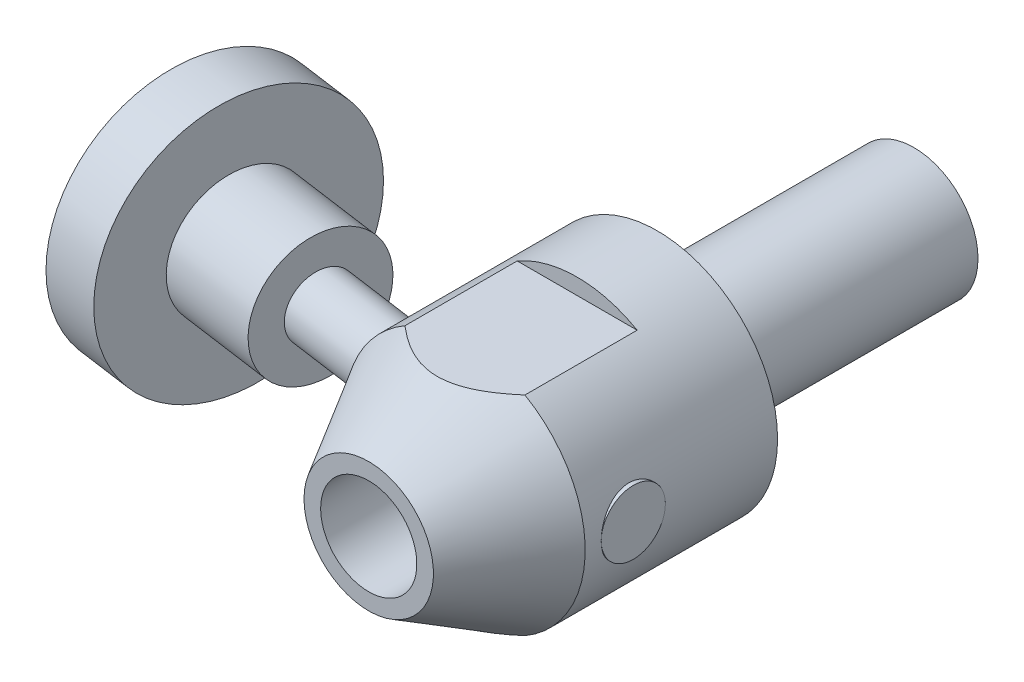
ISO-10303-21;
HEADER;
FILE_DESCRIPTION(('STEP AP214'),'2;1');
FILE_NAME('part.step','',(''),(''),'','','');
FILE_SCHEMA(('AUTOMOTIVE_DESIGN { 1 0 10303 214 1 1 1 1 }'));
ENDSEC;
DATA;
#1=APPLICATION_CONTEXT('core data for automotive mechanical design processes');
#2=APPLICATION_PROTOCOL_DEFINITION('international standard','automotive_design',2000,#1);
#3=PRODUCT_CONTEXT('',#1,'mechanical');
#4=PRODUCT('Part','Part','',(#3));
#5=PRODUCT_RELATED_PRODUCT_CATEGORY('part','',(#4));
#6=PRODUCT_DEFINITION_FORMATION('','',#4);
#7=PRODUCT_DEFINITION_CONTEXT('part definition',#1,'design');
#8=PRODUCT_DEFINITION('design','',#6,#7);
#9=PRODUCT_DEFINITION_SHAPE('','',#8);
#10=(LENGTH_UNIT() NAMED_UNIT(*) SI_UNIT(.MILLI.,.METRE.));
#11=(NAMED_UNIT(*) PLANE_ANGLE_UNIT() SI_UNIT($,.RADIAN.));
#12=(NAMED_UNIT(*) SI_UNIT($,.STERADIAN.) SOLID_ANGLE_UNIT());
#13=UNCERTAINTY_MEASURE_WITH_UNIT(LENGTH_MEASURE(1.E-05),#10,'distance_accuracy_value','');
#14=(GEOMETRIC_REPRESENTATION_CONTEXT(3) GLOBAL_UNCERTAINTY_ASSIGNED_CONTEXT((#13)) GLOBAL_UNIT_ASSIGNED_CONTEXT((#10,
#11,#12)) REPRESENTATION_CONTEXT('',''));
#15=CARTESIAN_POINT('',(0.,0.,0.));
#16=DIRECTION('',(0.,0.,1.));
#17=DIRECTION('',(1.,0.,0.));
#18=AXIS2_PLACEMENT_3D('',#15,#16,#17);
#19=CARTESIAN_POINT('',(7.5,0.,11.));
#20=DIRECTION('',(-1.,0.,0.));
#21=DIRECTION('',(0.,0.,1.));
#22=AXIS2_PLACEMENT_3D('',#19,#20,#21);
#23=PLANE('',#22);
#24=CARTESIAN_POINT('',(7.5,0.,9.));
#25=DIRECTION('',(1.,0.,0.));
#26=DIRECTION('',(0.,0.,-1.));
#27=AXIS2_PLACEMENT_3D('',#24,#25,#26);
#28=CIRCLE('',#27,2.);
#29=CARTESIAN_POINT('',(7.5,0.,7.));
#30=VERTEX_POINT('',#29);
#31=CARTESIAN_POINT('',(7.5,0.,11.));
#32=VERTEX_POINT('',#31);
#33=EDGE_CURVE('E249',#30,#32,#28,.T.);
#34=ORIENTED_EDGE('',*,*,#33,.T.);
#35=EDGE_CURVE('E89',#32,#30,#28,.T.);
#36=ORIENTED_EDGE('',*,*,#35,.T.);
#37=EDGE_LOOP('',(#34,#36));
#38=FACE_BOUND('',#37,.T.);
#39=ADVANCED_FACE('F14',(#38),#23,.F.);
#40=CARTESIAN_POINT('',(7.5,0.,9.));
#41=DIRECTION('',(1.,0.,0.));
#42=DIRECTION('',(0.,0.,-1.));
#43=AXIS2_PLACEMENT_3D('',#40,#41,#42);
#44=CYLINDRICAL_SURFACE('',#43,2.);
#45=CARTESIAN_POINT('',(7.5,0.,7.));
#46=CARTESIAN_POINT('',(7.49999833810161,-0.110254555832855,7.00000261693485));
#47=CARTESIAN_POINT('',(7.49754486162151,-0.220537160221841,7.00914761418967));
#48=CARTESIAN_POINT('',(7.48799573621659,-0.437925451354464,7.04542123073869));
#49=CARTESIAN_POINT('',(7.48089785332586,-0.545029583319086,7.07255850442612));
#50=CARTESIAN_POINT('',(7.46284333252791,-0.752891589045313,7.14387166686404));
#51=CARTESIAN_POINT('',(7.45189167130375,-0.853657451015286,7.18802558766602));
#52=CARTESIAN_POINT('',(7.42728699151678,-1.04635368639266,7.29203724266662));
#53=CARTESIAN_POINT('',(7.4136337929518,-1.13828347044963,7.35189602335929));
#54=CARTESIAN_POINT('',(7.38474614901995,-1.31282950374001,7.48708351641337));
#55=CARTESIAN_POINT('',(7.36948467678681,-1.39521168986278,7.56270866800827));
#56=CARTESIAN_POINT('',(7.33927409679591,-1.54628713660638,7.72664848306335));
#57=CARTESIAN_POINT('',(7.32432502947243,-1.61497863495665,7.81496477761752));
#58=CARTESIAN_POINT('',(7.29615537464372,-1.73786409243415,8.00364823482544));
#59=CARTESIAN_POINT('',(7.28296888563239,-1.79178877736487,8.10419632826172));
#60=CARTESIAN_POINT('',(7.26021477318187,-1.88187548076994,8.31334011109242));
#61=CARTESIAN_POINT('',(7.25064648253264,-1.91804077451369,8.42193431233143));
#62=CARTESIAN_POINT('',(7.23649115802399,-1.97076920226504,8.64149553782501));
#63=CARTESIAN_POINT('',(7.2317964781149,-1.98775670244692,8.75235353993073));
#64=CARTESIAN_POINT('',(7.22759830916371,-2.0029703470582,8.97543768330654));
#65=CARTESIAN_POINT('',(7.22809385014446,-2.00119999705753,9.08766356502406));
#66=CARTESIAN_POINT('',(7.23412378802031,-1.97928510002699,9.30698541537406));
#67=CARTESIAN_POINT('',(7.23951735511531,-1.95965406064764,9.41413718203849));
#68=CARTESIAN_POINT('',(7.25451013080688,-1.90339748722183,9.62356833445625));
#69=CARTESIAN_POINT('',(7.26410967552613,-1.86677059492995,9.72584733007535));
#70=CARTESIAN_POINT('',(7.28655661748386,-1.77714356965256,9.92396814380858));
#71=CARTESIAN_POINT('',(7.29943942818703,-1.72396341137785,10.0197243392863));
#72=CARTESIAN_POINT('',(7.32698229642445,-1.60286503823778,10.2011341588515));
#73=CARTESIAN_POINT('',(7.34164270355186,-1.53494392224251,10.2867857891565));
#74=CARTESIAN_POINT('',(7.37167510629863,-1.38366607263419,10.4484889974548));
#75=CARTESIAN_POINT('',(7.38705471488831,-1.29987812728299,10.5241363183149));
#76=CARTESIAN_POINT('',(7.41636381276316,-1.12061766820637,10.6603887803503));
#77=CARTESIAN_POINT('',(7.43029324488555,-1.02514469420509,10.7209933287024));
#78=CARTESIAN_POINT('',(7.45521820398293,-0.824598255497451,10.8256179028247));
#79=CARTESIAN_POINT('',(7.4662007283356,-0.719484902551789,10.8695647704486));
#80=CARTESIAN_POINT('',(7.48390044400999,-0.503002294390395,10.9390471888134));
#81=CARTESIAN_POINT('',(7.4906185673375,-0.391634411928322,10.964586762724));
#82=CARTESIAN_POINT('',(7.49889158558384,-0.169254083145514,10.9958948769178));
#83=CARTESIAN_POINT('',(7.50058997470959,-0.0583242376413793,11.0022130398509));
#84=CARTESIAN_POINT('',(7.49904471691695,0.1630100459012,10.9964168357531));
#85=CARTESIAN_POINT('',(7.49580158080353,0.273414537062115,10.9843043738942));
#86=CARTESIAN_POINT('',(7.48483035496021,0.48860244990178,10.94244155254));
#87=CARTESIAN_POINT('',(7.4771802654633,0.593449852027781,10.9129977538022));
#88=CARTESIAN_POINT('',(7.45826294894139,0.796706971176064,10.8376640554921));
#89=CARTESIAN_POINT('',(7.44699532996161,0.895115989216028,10.7917723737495));
#90=CARTESIAN_POINT('',(7.42175660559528,1.08483847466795,10.6838261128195));
#91=CARTESIAN_POINT('',(7.40773686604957,1.17597518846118,10.6214725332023));
#92=CARTESIAN_POINT('',(7.37861452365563,1.34668463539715,10.482748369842));
#93=CARTESIAN_POINT('',(7.3635117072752,1.42625507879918,10.4063750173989));
#94=CARTESIAN_POINT('',(7.33339745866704,1.57388924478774,10.2392144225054));
#95=CARTESIAN_POINT('',(7.31840061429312,1.64156519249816,10.1480814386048));
#96=CARTESIAN_POINT('',(7.29066447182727,1.76067191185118,9.95543530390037));
#97=CARTESIAN_POINT('',(7.27792507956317,1.81210336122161,9.85392258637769));
#98=CARTESIAN_POINT('',(7.2562926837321,1.89687411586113,9.64390469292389));
#99=CARTESIAN_POINT('',(7.24737748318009,1.93031812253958,9.53544418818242));
#100=CARTESIAN_POINT('',(7.234398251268,1.97841205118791,9.31416068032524));
#101=CARTESIAN_POINT('',(7.23033298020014,1.99306677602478,9.20133879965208));
#102=CARTESIAN_POINT('',(7.22761744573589,2.00288989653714,8.9785052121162));
#103=CARTESIAN_POINT('',(7.22879397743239,1.99868155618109,8.86852267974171));
#104=CARTESIAN_POINT('',(7.23602396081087,1.97234376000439,8.65089648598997));
#105=CARTESIAN_POINT('',(7.24207728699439,1.95021476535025,8.54325276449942));
#106=CARTESIAN_POINT('',(7.25827571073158,1.88902515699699,8.33414424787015));
#107=CARTESIAN_POINT('',(7.26838885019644,1.8500966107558,8.23263815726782));
#108=CARTESIAN_POINT('',(7.29156818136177,1.75651554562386,8.03752116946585));
#109=CARTESIAN_POINT('',(7.30463483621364,1.70186056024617,7.9439115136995));
#110=CARTESIAN_POINT('',(7.3327292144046,1.57648909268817,7.76426964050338));
#111=CARTESIAN_POINT('',(7.3478033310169,1.50534729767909,7.67854146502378));
#112=CARTESIAN_POINT('',(7.37795503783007,1.349830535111,7.52003754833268));
#113=CARTESIAN_POINT('',(7.39303262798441,1.26545235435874,7.44726496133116));
#114=CARTESIAN_POINT('',(7.42187812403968,1.08367998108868,7.31520776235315));
#115=CARTESIAN_POINT('',(7.43561111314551,0.986045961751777,7.25624498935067));
#116=CARTESIAN_POINT('',(7.45983810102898,0.781888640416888,7.15566258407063));
#117=CARTESIAN_POINT('',(7.47033417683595,0.675371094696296,7.1140318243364));
#118=CARTESIAN_POINT('',(7.48554752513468,0.47437470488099,7.05472471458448));
#119=CARTESIAN_POINT('',(7.49092770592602,0.380762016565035,7.0342506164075));
#120=CARTESIAN_POINT('',(7.49815449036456,0.191439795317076,7.00688779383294));
#121=CARTESIAN_POINT('',(7.5000014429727,0.09573047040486,6.99999772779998));
#122=CARTESIAN_POINT('',(7.5,0.,7.));
#123=B_SPLINE_CURVE_WITH_KNOTS('',3,(#45,#46,#47,#48,#49,#50,#51,#52,#53,#54,#55,#56,#57,#58,
#59,#60,#61,#62,#63,#64,#65,#66,#67,#68,#69,#70,#71,#72,#73,#74,#75,#76,#77,#78,#79,#80,#81,#82,
#83,#84,#85,#86,#87,#88,#89,#90,#91,#92,#93,#94,#95,#96,#97,#98,#99,#100,#101,#102,#103,#104,
#105,#106,#107,#108,#109,#110,#111,#112,#113,#114,#115,#116,#117,#118,#119,#120,#121,#122),
.UNSPECIFIED.,.T.,.F.,(4,2,2,2,2,2,2,2,2,2,2,2,2,2,2,2,2,2,2,2,2,2,2,2,2,2,2,2,2,2,2,2,2,2,2,2,
2,2,4),(0.,0.33041259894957,0.660984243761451,0.991130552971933,1.32129886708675,
1.65834897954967,1.99544244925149,2.33832582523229,2.68114594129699,3.01622158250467,
3.35123460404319,3.67691002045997,4.0026114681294,4.33198673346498,4.66142688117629,
5.00161259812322,5.34181171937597,5.68348809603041,6.02508977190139,6.35682717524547,
6.68853028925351,7.01453535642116,7.34057575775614,7.6730028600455,8.00549568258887,
8.34736496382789,8.68921998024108,9.02906297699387,9.36881908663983,9.69743342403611,
10.0260393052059,10.352107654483,10.67822717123,11.0139433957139,11.3497412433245,
11.692722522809,12.0354832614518,12.3223981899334,12.6092847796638),.UNSPECIFIED.);
#124=EDGE_CURVE('E24',#32,#30,#123,.T.);
#125=ORIENTED_EDGE('',*,*,#124,.F.);
#126=ORIENTED_EDGE('',*,*,#33,.F.);
#127=EDGE_LOOP('',(#125,#126));
#128=FACE_BOUND('',#127,.T.);
#129=ADVANCED_FACE('F254',(#128),#44,.T.);
#130=EDGE_CURVE('E9',#30,#32,#123,.T.);
#131=ORIENTED_EDGE('',*,*,#130,.F.);
#132=ORIENTED_EDGE('',*,*,#35,.F.);
#133=EDGE_LOOP('',(#131,#132));
#134=FACE_BOUND('',#133,.T.);
#135=ADVANCED_FACE('F106',(#134),#44,.T.);
#136=CARTESIAN_POINT('',(-18.3642754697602,0.,6.47312565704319));
#137=DIRECTION('',(0.99026806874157,0.,0.139173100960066));
#138=DIRECTION('',(0.139173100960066,0.,-0.99026806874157));
#139=AXIS2_PLACEMENT_3D('',#136,#137,#138);
#140=PLANE('',#139);
#141=CARTESIAN_POINT('',(-18.3642754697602,0.,6.47312565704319));
#142=DIRECTION('',(-0.99026806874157,0.,-0.139173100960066));
#143=DIRECTION('',(-0.139173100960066,0.,0.99026806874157));
#144=AXIS2_PLACEMENT_3D('',#141,#142,#143);
#145=CIRCLE('',#144,2.);
#146=CARTESIAN_POINT('',(-18.3642754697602,-2.,6.47312565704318));
#147=VERTEX_POINT('',#146);
#148=EDGE_CURVE('E216',#147,#147,#145,.T.);
#149=ORIENTED_EDGE('',*,*,#148,.T.);
#150=EDGE_LOOP('',(#149));
#151=FACE_BOUND('',#150,.T.);
#152=ADVANCED_FACE('F167',(#151),#140,.F.);
#153=CARTESIAN_POINT('',(6.76309288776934,0.,10.0045469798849));
#154=DIRECTION('',(0.99026806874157,0.,0.139173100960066));
#155=DIRECTION('',(0.,-1.,0.));
#156=AXIS2_PLACEMENT_3D('',#153,#154,#155);
#157=CYLINDRICAL_SURFACE('',#156,2.);
#158=CARTESIAN_POINT('',(-23.315615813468,0.,5.77726015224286));
#159=DIRECTION('',(0.99026806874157,0.,0.139173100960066));
#160=DIRECTION('',(0.,-1.,0.));
#161=AXIS2_PLACEMENT_3D('',#158,#159,#160);
#162=CIRCLE('',#161,2.);
#163=CARTESIAN_POINT('',(-23.315615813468,-2.,5.77726015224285));
#164=VERTEX_POINT('',#163);
#165=EDGE_CURVE('E18',#164,#164,#162,.T.);
#166=CARTESIAN_POINT('',(-23.315615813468,-2.,5.77726015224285));
#167=CARTESIAN_POINT('',(-23.2640393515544,-2.,5.78450875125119));
#168=CARTESIAN_POINT('',(-23.2124628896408,-2.,5.79175735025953));
#169=CARTESIAN_POINT('',(-23.1093099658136,-2.,5.8062545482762));
#170=CARTESIAN_POINT('',(-23.0577335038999,-2.,5.81350314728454));
#171=CARTESIAN_POINT('',(-22.9545805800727,-2.,5.82800034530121));
#172=CARTESIAN_POINT('',(-22.9030041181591,-2.,5.83524894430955));
#173=CARTESIAN_POINT('',(-22.7998511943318,-2.,5.84974614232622));
#174=CARTESIAN_POINT('',(-22.7482747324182,-2.,5.85699474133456));
#175=CARTESIAN_POINT('',(-22.6451218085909,-2.,5.87149193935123));
#176=CARTESIAN_POINT('',(-22.5935453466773,-2.,5.87874053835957));
#177=CARTESIAN_POINT('',(-22.4903924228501,-2.,5.89323773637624));
#178=CARTESIAN_POINT('',(-22.4388159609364,-2.,5.90048633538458));
#179=CARTESIAN_POINT('',(-22.3356630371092,-2.,5.91498353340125));
#180=CARTESIAN_POINT('',(-22.2840865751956,-2.,5.92223213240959));
#181=CARTESIAN_POINT('',(-22.1809336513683,-2.,5.93672933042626));
#182=CARTESIAN_POINT('',(-22.1293571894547,-2.,5.9439779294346));
#183=CARTESIAN_POINT('',(-22.0262042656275,-2.,5.95847512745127));
#184=CARTESIAN_POINT('',(-21.9746278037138,-2.,5.96572372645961));
#185=CARTESIAN_POINT('',(-21.8714748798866,-2.,5.98022092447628));
#186=CARTESIAN_POINT('',(-21.819898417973,-2.,5.98746952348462));
#187=CARTESIAN_POINT('',(-21.7167454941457,-2.,6.00196672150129));
#188=CARTESIAN_POINT('',(-21.6651690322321,-2.,6.00921532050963));
#189=CARTESIAN_POINT('',(-21.5620161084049,-2.,6.02371251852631));
#190=CARTESIAN_POINT('',(-21.5104396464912,-2.,6.03096111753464));
#191=CARTESIAN_POINT('',(-21.407286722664,-2.,6.04545831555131));
#192=CARTESIAN_POINT('',(-21.3557102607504,-2.,6.05270691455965));
#193=CARTESIAN_POINT('',(-21.2525573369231,-2.,6.06720411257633));
#194=CARTESIAN_POINT('',(-21.2009808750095,-2.,6.07445271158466));
#195=CARTESIAN_POINT('',(-21.0978279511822,-2.,6.08894990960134));
#196=CARTESIAN_POINT('',(-21.0462514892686,-2.,6.09619850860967));
#197=CARTESIAN_POINT('',(-20.9430985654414,-2.,6.11069570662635));
#198=CARTESIAN_POINT('',(-20.8915221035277,-2.,6.11794430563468));
#199=CARTESIAN_POINT('',(-20.7883691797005,-2.,6.13244150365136));
#200=CARTESIAN_POINT('',(-20.7367927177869,-2.,6.13969010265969));
#201=CARTESIAN_POINT('',(-20.6336397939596,-2.,6.15418730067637));
#202=CARTESIAN_POINT('',(-20.582063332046,-2.,6.1614358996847));
#203=CARTESIAN_POINT('',(-20.4789104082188,-2.,6.17593309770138));
#204=CARTESIAN_POINT('',(-20.4273339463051,-2.,6.18318169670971));
#205=CARTESIAN_POINT('',(-20.3241810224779,-2.,6.19767889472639));
#206=CARTESIAN_POINT('',(-20.2726045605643,-2.,6.20492749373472));
#207=CARTESIAN_POINT('',(-20.169451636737,-2.,6.2194246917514));
#208=CARTESIAN_POINT('',(-20.1178751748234,-2.,6.22667329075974));
#209=CARTESIAN_POINT('',(-20.0147222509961,-2.,6.24117048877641));
#210=CARTESIAN_POINT('',(-19.9631457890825,-2.,6.24841908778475));
#211=CARTESIAN_POINT('',(-19.8599928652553,-2.,6.26291628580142));
#212=CARTESIAN_POINT('',(-19.8084164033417,-2.,6.27016488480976));
#213=CARTESIAN_POINT('',(-19.7052634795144,-2.,6.28466208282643));
#214=CARTESIAN_POINT('',(-19.6536870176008,-2.,6.29191068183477));
#215=CARTESIAN_POINT('',(-19.5505340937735,-2.,6.30640787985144));
#216=CARTESIAN_POINT('',(-19.4989576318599,-2.,6.31365647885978));
#217=CARTESIAN_POINT('',(-19.3958047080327,-2.,6.32815367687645));
#218=CARTESIAN_POINT('',(-19.344228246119,-2.,6.33540227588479));
#219=CARTESIAN_POINT('',(-19.2410753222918,-2.,6.34989947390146));
#220=CARTESIAN_POINT('',(-19.1894988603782,-2.,6.3571480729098));
#221=CARTESIAN_POINT('',(-19.0863459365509,-2.,6.37164527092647));
#222=CARTESIAN_POINT('',(-19.0347694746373,-2.,6.37889386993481));
#223=CARTESIAN_POINT('',(-18.9316165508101,-2.,6.39339106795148));
#224=CARTESIAN_POINT('',(-18.8800400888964,-2.,6.40063966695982));
#225=CARTESIAN_POINT('',(-18.7768871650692,-2.,6.41513686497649));
#226=CARTESIAN_POINT('',(-18.7253107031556,-2.,6.42238546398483));
#227=CARTESIAN_POINT('',(-18.6221577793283,-2.,6.4368826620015));
#228=CARTESIAN_POINT('',(-18.5705813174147,-2.,6.44413126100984));
#229=CARTESIAN_POINT('',(-18.4674283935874,-2.,6.45862845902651));
#230=CARTESIAN_POINT('',(-18.4158519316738,-2.,6.46587705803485));
#231=CARTESIAN_POINT('',(-18.3642754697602,-2.,6.47312565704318));
#232=B_SPLINE_CURVE_WITH_KNOTS('',3,(#166,#167,#168,#169,#170,#171,#172,#173,#174,#175,#176,
#177,#178,#179,#180,#181,#182,#183,#184,#185,#186,#187,#188,#189,#190,#191,#192,#193,#194,#195,
#196,#197,#198,#199,#200,#201,#202,#203,#204,#205,#206,#207,#208,#209,#210,#211,#212,#213,#214,
#215,#216,#217,#218,#219,#220,#221,#222,#223,#224,#225,#226,#227,#228,#229,#230,#231),
.UNSPECIFIED.,.F.,.F.,(4,2,2,2,2,2,2,2,2,2,2,2,2,2,2,2,2,2,2,2,2,2,2,2,2,2,2,2,2,2,2,2,4),(0.,
0.156250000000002,0.312500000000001,0.46875,0.625000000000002,0.781250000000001,
0.937500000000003,1.09375,1.25,1.40625,1.5625,1.71875,1.875,2.03125,2.1875,2.34375,2.5,2.65625,
2.8125,2.96875,3.125,3.28125,3.4375,3.59375,3.75,3.90625,4.0625,4.21875,4.375,4.53125,4.6875,
4.84375,5.),.UNSPECIFIED.);
#233=EDGE_CURVE('BSEAM191',#164,#147,#232,.T.);
#234=ORIENTED_EDGE('',*,*,#165,.F.);
#235=ORIENTED_EDGE('',*,*,#148,.F.);
#236=ORIENTED_EDGE('',*,*,#233,.T.);
#237=ORIENTED_EDGE('',*,*,#233,.F.);
#238=EDGE_LOOP('',(#234,#236,#235,#237));
#239=FACE_BOUND('',#238,.T.);
#240=ADVANCED_FACE('F191',(#239),#157,.F.);
#241=CARTESIAN_POINT('',(-23.315615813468,2.,5.77726015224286));
#242=DIRECTION('',(0.99026806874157,0.,0.139173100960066));
#243=DIRECTION('',(0.,-1.,0.));
#244=AXIS2_PLACEMENT_3D('',#241,#242,#243);
#245=PLANE('',#244);
#246=CARTESIAN_POINT('',(-23.315615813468,0.,5.77726015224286));
#247=DIRECTION('',(0.99026806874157,0.,0.139173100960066));
#248=DIRECTION('',(0.,-1.,0.));
#249=AXIS2_PLACEMENT_3D('',#246,#247,#248);
#250=CIRCLE('',#249,8.);
#251=CARTESIAN_POINT('',(-23.3156158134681,-8.,5.77726015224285));
#252=VERTEX_POINT('',#251);
#253=EDGE_CURVE('E221',#252,#252,#250,.T.);
#254=ORIENTED_EDGE('',*,*,#253,.F.);
#255=EDGE_LOOP('',(#254));
#256=FACE_BOUND('',#255,.T.);
#257=ORIENTED_EDGE('',*,*,#165,.T.);
#258=EDGE_LOOP('',(#257));
#259=FACE_BOUND('',#258,.T.);
#260=ADVANCED_FACE('F202',(#256,#259),#245,.F.);
#261=CARTESIAN_POINT('',(6.76309288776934,0.,10.0045469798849));
#262=DIRECTION('',(0.99026806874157,0.,0.139173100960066));
#263=DIRECTION('',(0.,-1.,0.));
#264=AXIS2_PLACEMENT_3D('',#261,#262,#263);
#265=CYLINDRICAL_SURFACE('',#264,8.);
#266=CARTESIAN_POINT('',(-19.8496775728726,0.,6.26436600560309));
#267=DIRECTION('',(0.99026806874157,0.,0.139173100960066));
#268=DIRECTION('',(0.,-1.,0.));
#269=AXIS2_PLACEMENT_3D('',#266,#267,#268);
#270=CIRCLE('',#269,8.);
#271=CARTESIAN_POINT('',(-19.8496775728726,-8.,6.26436600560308));
#272=VERTEX_POINT('',#271);
#273=EDGE_CURVE('E227',#272,#272,#270,.T.);
#274=CARTESIAN_POINT('',(-19.8496775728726,-8.,6.26436600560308));
#275=CARTESIAN_POINT('',(-19.8857810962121,-8.,6.25929198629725));
#276=CARTESIAN_POINT('',(-19.9218846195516,-8.,6.25421796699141));
#277=CARTESIAN_POINT('',(-19.9940916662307,-8.,6.24406992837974));
#278=CARTESIAN_POINT('',(-20.0301951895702,-8.,6.23899590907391));
#279=CARTESIAN_POINT('',(-20.1024022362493,-8.,6.22884787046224));
#280=CARTESIAN_POINT('',(-20.1385057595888,-8.,6.2237738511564));
#281=CARTESIAN_POINT('',(-20.2107128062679,-8.,6.21362581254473));
#282=CARTESIAN_POINT('',(-20.2468163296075,-8.,6.20855179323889));
#283=CARTESIAN_POINT('',(-20.3190233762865,-8.,6.19840375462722));
#284=CARTESIAN_POINT('',(-20.3551268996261,-8.,6.19332973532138));
#285=CARTESIAN_POINT('',(-20.4273339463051,-8.,6.18318169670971));
#286=CARTESIAN_POINT('',(-20.4634374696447,-8.,6.17810767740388));
#287=CARTESIAN_POINT('',(-20.5356445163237,-8.,6.16795963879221));
#288=CARTESIAN_POINT('',(-20.5717480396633,-8.,6.16288561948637));
#289=CARTESIAN_POINT('',(-20.6439550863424,-8.,6.1527375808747));
#290=CARTESIAN_POINT('',(-20.6800586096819,-8.,6.14766356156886));
#291=CARTESIAN_POINT('',(-20.752265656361,-8.,6.13751552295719));
#292=CARTESIAN_POINT('',(-20.7883691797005,-8.,6.13244150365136));
#293=CARTESIAN_POINT('',(-20.8605762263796,-8.,6.12229346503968));
#294=CARTESIAN_POINT('',(-20.8966797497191,-8.,6.11721944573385));
#295=CARTESIAN_POINT('',(-20.9688867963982,-8.,6.10707140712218));
#296=CARTESIAN_POINT('',(-21.0049903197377,-8.,6.10199738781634));
#297=CARTESIAN_POINT('',(-21.0771973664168,-8.,6.09184934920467));
#298=CARTESIAN_POINT('',(-21.1133008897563,-8.,6.08677532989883));
#299=CARTESIAN_POINT('',(-21.1855079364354,-8.,6.07662729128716));
#300=CARTESIAN_POINT('',(-21.2216114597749,-8.,6.07155327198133));
#301=CARTESIAN_POINT('',(-21.293818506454,-8.,6.06140523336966));
#302=CARTESIAN_POINT('',(-21.3299220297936,-8.,6.05633121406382));
#303=CARTESIAN_POINT('',(-21.4021290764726,-8.,6.04618317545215));
#304=CARTESIAN_POINT('',(-21.4382325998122,-8.,6.04110915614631));
#305=CARTESIAN_POINT('',(-21.5104396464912,-8.,6.03096111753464));
#306=CARTESIAN_POINT('',(-21.5465431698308,-8.,6.0258870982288));
#307=CARTESIAN_POINT('',(-21.6187502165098,-8.,6.01573905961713));
#308=CARTESIAN_POINT('',(-21.6548537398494,-8.,6.0106650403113));
#309=CARTESIAN_POINT('',(-21.7270607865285,-8.,6.00051700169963));
#310=CARTESIAN_POINT('',(-21.763164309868,-8.,5.99544298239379));
#311=CARTESIAN_POINT('',(-21.8353713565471,-8.,5.98529494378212));
#312=CARTESIAN_POINT('',(-21.8714748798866,-8.,5.98022092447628));
#313=CARTESIAN_POINT('',(-21.9436819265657,-8.,5.97007288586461));
#314=CARTESIAN_POINT('',(-21.9797854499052,-8.,5.96499886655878));
#315=CARTESIAN_POINT('',(-22.0519924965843,-8.,5.95485082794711));
#316=CARTESIAN_POINT('',(-22.0880960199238,-8.,5.94977680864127));
#317=CARTESIAN_POINT('',(-22.1603030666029,-8.,5.9396287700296));
#318=CARTESIAN_POINT('',(-22.1964065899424,-8.,5.93455475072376));
#319=CARTESIAN_POINT('',(-22.2686136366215,-8.,5.92440671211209));
#320=CARTESIAN_POINT('',(-22.304717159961,-8.,5.91933269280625));
#321=CARTESIAN_POINT('',(-22.3769242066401,-8.,5.90918465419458));
#322=CARTESIAN_POINT('',(-22.4130277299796,-8.,5.90411063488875));
#323=CARTESIAN_POINT('',(-22.4852347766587,-8.,5.89396259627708));
#324=CARTESIAN_POINT('',(-22.5213382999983,-8.,5.88888857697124));
#325=CARTESIAN_POINT('',(-22.5935453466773,-8.,5.87874053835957));
#326=CARTESIAN_POINT('',(-22.6296488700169,-8.,5.87366651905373));
#327=CARTESIAN_POINT('',(-22.7018559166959,-8.,5.86351848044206));
#328=CARTESIAN_POINT('',(-22.7379594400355,-8.,5.85844446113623));
#329=CARTESIAN_POINT('',(-22.8101664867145,-8.,5.84829642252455));
#330=CARTESIAN_POINT('',(-22.8462700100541,-8.,5.84322240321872));
#331=CARTESIAN_POINT('',(-22.9184770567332,-8.,5.83307436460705));
#332=CARTESIAN_POINT('',(-22.9545805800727,-8.,5.82800034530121));
#333=CARTESIAN_POINT('',(-23.0267876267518,-8.,5.81785230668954));
#334=CARTESIAN_POINT('',(-23.0628911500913,-8.,5.8127782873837));
#335=CARTESIAN_POINT('',(-23.1350981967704,-8.,5.80263024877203));
#336=CARTESIAN_POINT('',(-23.1712017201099,-8.,5.7975562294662));
#337=CARTESIAN_POINT('',(-23.243408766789,-8.,5.78740819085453));
#338=CARTESIAN_POINT('',(-23.2795122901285,-8.,5.78233417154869));
#339=CARTESIAN_POINT('',(-23.3156158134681,-8.,5.77726015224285));
#340=B_SPLINE_CURVE_WITH_KNOTS('',3,(#274,#275,#276,#277,#278,#279,#280,#281,#282,#283,#284,
#285,#286,#287,#288,#289,#290,#291,#292,#293,#294,#295,#296,#297,#298,#299,#300,#301,#302,#303,
#304,#305,#306,#307,#308,#309,#310,#311,#312,#313,#314,#315,#316,#317,#318,#319,#320,#321,#322,
#323,#324,#325,#326,#327,#328,#329,#330,#331,#332,#333,#334,#335,#336,#337,#338,#339),
.UNSPECIFIED.,.F.,.F.,(4,2,2,2,2,2,2,2,2,2,2,2,2,2,2,2,2,2,2,2,2,2,2,2,2,2,2,2,2,2,2,2,4),(0.,
0.109375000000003,0.21875,0.328124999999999,0.437500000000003,0.546875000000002,
0.656250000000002,0.765624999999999,0.875000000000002,0.984375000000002,1.09375,1.203125,1.3125,
1.421875,1.53125,1.640625,1.75,1.859375,1.96875,2.078125,2.1875,2.296875,2.40625,2.515625,2.625,
2.734375,2.84375,2.953125,3.0625,3.171875,3.28125,3.390625,3.5),.UNSPECIFIED.);
#341=EDGE_CURVE('BSEAM198',#272,#252,#340,.T.);
#342=ORIENTED_EDGE('',*,*,#273,.F.);
#343=ORIENTED_EDGE('',*,*,#253,.T.);
#344=ORIENTED_EDGE('',*,*,#341,.T.);
#345=ORIENTED_EDGE('',*,*,#341,.F.);
#346=EDGE_LOOP('',(#342,#344,#343,#345));
#347=FACE_BOUND('',#346,.T.);
#348=ADVANCED_FACE('F198',(#347),#265,.T.);
#349=CARTESIAN_POINT('',(-19.8496775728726,5.,6.26436600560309));
#350=DIRECTION('',(-0.99026806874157,0.,-0.139173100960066));
#351=DIRECTION('',(0.,1.,0.));
#352=AXIS2_PLACEMENT_3D('',#349,#350,#351);
#353=PLANE('',#352);
#354=ORIENTED_EDGE('',*,*,#273,.T.);
#355=EDGE_LOOP('',(#354));
#356=FACE_BOUND('',#355,.T.);
#357=CARTESIAN_POINT('',(-19.8496775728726,0.,6.26436600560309));
#358=DIRECTION('',(-0.99026806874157,0.,-0.139173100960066));
#359=DIRECTION('',(-0.139173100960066,0.,0.99026806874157));
#360=AXIS2_PLACEMENT_3D('',#357,#358,#359);
#361=CIRCLE('',#360,4.);
#362=CARTESIAN_POINT('',(-19.8496775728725,-4.,6.26436600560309));
#363=VERTEX_POINT('',#362);
#364=EDGE_CURVE('E98',#363,#363,#361,.F.);
#365=ORIENTED_EDGE('',*,*,#364,.F.);
#366=EDGE_LOOP('',(#365));
#367=FACE_BOUND('',#366,.T.);
#368=ADVANCED_FACE('F151',(#356,#367),#353,.F.);
#369=CARTESIAN_POINT('',(2.8,0.,-16.));
#370=DIRECTION('',(0.,0.,1.));
#371=DIRECTION('',(1.,0.,0.));
#372=AXIS2_PLACEMENT_3D('',#369,#370,#371);
#373=PLANE('',#372);
#374=CARTESIAN_POINT('',(0.,0.,-16.));
#375=DIRECTION('',(0.,0.,1.));
#376=DIRECTION('',(1.,0.,0.));
#377=AXIS2_PLACEMENT_3D('',#374,#375,#376);
#378=CIRCLE('',#377,4.);
#379=CARTESIAN_POINT('',(4.,0.,-16.));
#380=VERTEX_POINT('',#379);
#381=EDGE_CURVE('E217',#380,#380,#378,.F.);
#382=ORIENTED_EDGE('',*,*,#381,.T.);
#383=EDGE_LOOP('',(#382));
#384=FACE_BOUND('',#383,.T.);
#385=ADVANCED_FACE('F147',(#384),#373,.F.);
#386=CARTESIAN_POINT('',(6.76309288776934,0.,10.0045469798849));
#387=DIRECTION('',(0.99026806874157,0.,0.139173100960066));
#388=DIRECTION('',(0.,-1.,0.));
#389=AXIS2_PLACEMENT_3D('',#386,#387,#388);
#390=CYLINDRICAL_SURFACE('',#389,4.);
#391=CARTESIAN_POINT('',(-13.9080691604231,0.,7.09940461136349));
#392=DIRECTION('',(0.99026806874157,0.,0.139173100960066));
#393=DIRECTION('',(0.,-1.,0.));
#394=AXIS2_PLACEMENT_3D('',#391,#392,#393);
#395=CIRCLE('',#394,4.);
#396=CARTESIAN_POINT('',(-13.9080691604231,-4.,7.09940461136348));
#397=VERTEX_POINT('',#396);
#398=EDGE_CURVE('E224',#397,#397,#395,.T.);
#399=CARTESIAN_POINT('',(-13.9080691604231,-4.,7.09940461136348));
#400=CARTESIAN_POINT('',(-13.9699609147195,-4.,7.09070629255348));
#401=CARTESIAN_POINT('',(-14.0318526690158,-4.,7.08200797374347));
#402=CARTESIAN_POINT('',(-14.1556361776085,-4.,7.06461133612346));
#403=CARTESIAN_POINT('',(-14.2175279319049,-4.,7.05591301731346));
#404=CARTESIAN_POINT('',(-14.3413114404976,-4.,7.03851637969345));
#405=CARTESIAN_POINT('',(-14.4032031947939,-4.,7.02981806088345));
#406=CARTESIAN_POINT('',(-14.5269867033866,-4.,7.01242142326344));
#407=CARTESIAN_POINT('',(-14.588878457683,-4.,7.00372310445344));
#408=CARTESIAN_POINT('',(-14.7126619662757,-4.,6.98632646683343));
#409=CARTESIAN_POINT('',(-14.774553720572,-4.,6.97762814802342));
#410=CARTESIAN_POINT('',(-14.8983372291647,-4.,6.96023151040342));
#411=CARTESIAN_POINT('',(-14.9602289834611,-4.,6.95153319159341));
#412=CARTESIAN_POINT('',(-15.0840124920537,-4.,6.9341365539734));
#413=CARTESIAN_POINT('',(-15.1459042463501,-4.,6.9254382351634));
#414=CARTESIAN_POINT('',(-15.2696877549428,-4.,6.90804159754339));
#415=CARTESIAN_POINT('',(-15.3315795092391,-4.,6.89934327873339));
#416=CARTESIAN_POINT('',(-15.4553630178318,-4.,6.88194664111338));
#417=CARTESIAN_POINT('',(-15.5172547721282,-4.,6.87324832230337));
#418=CARTESIAN_POINT('',(-15.6410382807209,-4.,6.85585168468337));
#419=CARTESIAN_POINT('',(-15.7029300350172,-4.,6.84715336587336));
#420=CARTESIAN_POINT('',(-15.8267135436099,-4.,6.82975672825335));
#421=CARTESIAN_POINT('',(-15.8886052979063,-4.,6.82105840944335));
#422=CARTESIAN_POINT('',(-16.012388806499,-4.,6.80366177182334));
#423=CARTESIAN_POINT('',(-16.0742805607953,-4.,6.79496345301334));
#424=CARTESIAN_POINT('',(-16.198064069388,-4.,6.77756681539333));
#425=CARTESIAN_POINT('',(-16.2599558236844,-4.,6.76886849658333));
#426=CARTESIAN_POINT('',(-16.3837393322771,-4.,6.75147185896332));
#427=CARTESIAN_POINT('',(-16.4456310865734,-4.,6.74277354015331));
#428=CARTESIAN_POINT('',(-16.5694145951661,-4.,6.7253769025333));
#429=CARTESIAN_POINT('',(-16.6313063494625,-4.,6.7166785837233));
#430=CARTESIAN_POINT('',(-16.7550898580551,-4.,6.69928194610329));
#431=CARTESIAN_POINT('',(-16.8169816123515,-4.,6.69058362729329));
#432=CARTESIAN_POINT('',(-16.9407651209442,-4.,6.67318698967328));
#433=CARTESIAN_POINT('',(-17.0026568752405,-4.,6.66448867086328));
#434=CARTESIAN_POINT('',(-17.1264403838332,-4.,6.64709203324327));
#435=CARTESIAN_POINT('',(-17.1883321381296,-4.,6.63839371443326));
#436=CARTESIAN_POINT('',(-17.3121156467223,-4.,6.62099707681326));
#437=CARTESIAN_POINT('',(-17.3740074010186,-4.,6.61229875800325));
#438=CARTESIAN_POINT('',(-17.4977909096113,-4.,6.59490212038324));
#439=CARTESIAN_POINT('',(-17.5596826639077,-4.,6.58620380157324));
#440=CARTESIAN_POINT('',(-17.6834661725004,-4.,6.56880716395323));
#441=CARTESIAN_POINT('',(-17.7453579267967,-4.,6.56010884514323));
#442=CARTESIAN_POINT('',(-17.8691414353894,-4.,6.54271220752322));
#443=CARTESIAN_POINT('',(-17.9310331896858,-4.,6.53401388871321));
#444=CARTESIAN_POINT('',(-18.0548166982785,-4.,6.51661725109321));
#445=CARTESIAN_POINT('',(-18.1167084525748,-4.,6.5079189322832));
#446=CARTESIAN_POINT('',(-18.2404919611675,-4.,6.49052229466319));
#447=CARTESIAN_POINT('',(-18.3023837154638,-4.,6.48182397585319));
#448=CARTESIAN_POINT('',(-18.4261672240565,-4.,6.46442733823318));
#449=CARTESIAN_POINT('',(-18.4880589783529,-4.,6.45572901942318));
#450=CARTESIAN_POINT('',(-18.6118424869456,-4.,6.43833238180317));
#451=CARTESIAN_POINT('',(-18.6737342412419,-4.,6.42963406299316));
#452=CARTESIAN_POINT('',(-18.7975177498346,-4.,6.41223742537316));
#453=CARTESIAN_POINT('',(-18.859409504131,-4.,6.40353910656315));
#454=CARTESIAN_POINT('',(-18.9831930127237,-4.,6.38614246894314));
#455=CARTESIAN_POINT('',(-19.04508476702,-4.,6.37744415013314));
#456=CARTESIAN_POINT('',(-19.1688682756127,-4.,6.36004751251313));
#457=CARTESIAN_POINT('',(-19.2307600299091,-4.,6.35134919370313));
#458=CARTESIAN_POINT('',(-19.3545435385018,-4.,6.33395255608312));
#459=CARTESIAN_POINT('',(-19.4164352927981,-4.,6.32525423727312));
#460=CARTESIAN_POINT('',(-19.5402188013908,-4.,6.30785759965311));
#461=CARTESIAN_POINT('',(-19.6021105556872,-4.,6.2991592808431));
#462=CARTESIAN_POINT('',(-19.7258940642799,-4.,6.28176264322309));
#463=CARTESIAN_POINT('',(-19.7877858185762,-4.,6.27306432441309));
#464=CARTESIAN_POINT('',(-19.8496775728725,-4.,6.26436600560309));
#465=B_SPLINE_CURVE_WITH_KNOTS('',3,(#399,#400,#401,#402,#403,#404,#405,#406,#407,#408,#409,
#410,#411,#412,#413,#414,#415,#416,#417,#418,#419,#420,#421,#422,#423,#424,#425,#426,#427,#428,
#429,#430,#431,#432,#433,#434,#435,#436,#437,#438,#439,#440,#441,#442,#443,#444,#445,#446,#447,
#448,#449,#450,#451,#452,#453,#454,#455,#456,#457,#458,#459,#460,#461,#462,#463,#464),
.UNSPECIFIED.,.F.,.F.,(4,2,2,2,2,2,2,2,2,2,2,2,2,2,2,2,2,2,2,2,2,2,2,2,2,2,2,2,2,2,2,2,4),(0.,
0.187499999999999,0.374999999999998,0.562499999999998,0.75,0.937499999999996,1.12499999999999,
1.31249999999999,1.5,1.6875,1.875,2.0625,2.24999999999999,2.43749999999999,2.62499999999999,
2.81249999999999,2.99999999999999,3.18749999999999,3.37499999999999,3.5625,3.74999999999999,
3.93749999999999,4.12499999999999,4.31249999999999,4.49999999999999,4.68749999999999,
4.87499999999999,5.06249999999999,5.24999999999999,5.43749999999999,5.62499999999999,
5.81249999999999,5.99999999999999),.UNSPECIFIED.);
#466=EDGE_CURVE('BSEAM150',#397,#363,#465,.T.);
#467=ORIENTED_EDGE('',*,*,#398,.F.);
#468=ORIENTED_EDGE('',*,*,#364,.T.);
#469=ORIENTED_EDGE('',*,*,#466,.T.);
#470=ORIENTED_EDGE('',*,*,#466,.F.);
#471=EDGE_LOOP('',(#467,#469,#468,#470));
#472=FACE_BOUND('',#471,.T.);
#473=ADVANCED_FACE('F150',(#472),#390,.T.);
#474=CARTESIAN_POINT('',(1.25,0.,3.));
#475=DIRECTION('',(0.,0.,-1.));
#476=DIRECTION('',(-1.,0.,0.));
#477=AXIS2_PLACEMENT_3D('',#474,#475,#476);
#478=PLANE('',#477);
#479=CARTESIAN_POINT('',(0.,0.,3.));
#480=DIRECTION('',(0.,0.,-1.));
#481=DIRECTION('',(-1.,0.,0.));
#482=AXIS2_PLACEMENT_3D('',#479,#480,#481);
#483=CIRCLE('',#482,3.);
#484=CARTESIAN_POINT('',(-3.,0.,3.));
#485=VERTEX_POINT('',#484);
#486=EDGE_CURVE('E403',#485,#485,#483,.T.);
#487=ORIENTED_EDGE('',*,*,#486,.F.);
#488=EDGE_LOOP('',(#487));
#489=FACE_BOUND('',#488,.T.);
#490=ADVANCED_FACE('F155',(#489),#478,.F.);
#491=CARTESIAN_POINT('',(0.,0.,-38.3689686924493));
#492=DIRECTION('',(0.,0.,-1.));
#493=DIRECTION('',(-1.,0.,0.));
#494=AXIS2_PLACEMENT_3D('',#491,#492,#493);
#495=CYLINDRICAL_SURFACE('',#494,4.);
#496=ORIENTED_EDGE('',*,*,#381,.F.);
#497=EDGE_LOOP('',(#496));
#498=FACE_BOUND('',#497,.T.);
#499=CARTESIAN_POINT('',(0.,0.,0.));
#500=DIRECTION('',(0.,0.,1.));
#501=DIRECTION('',(1.,0.,0.));
#502=AXIS2_PLACEMENT_3D('',#499,#500,#501);
#503=CIRCLE('',#502,4.);
#504=CARTESIAN_POINT('',(4.,0.,0.));
#505=VERTEX_POINT('',#504);
#506=EDGE_CURVE('E97',#505,#505,#503,.T.);
#507=ORIENTED_EDGE('',*,*,#506,.F.);
#508=EDGE_LOOP('',(#507));
#509=FACE_BOUND('',#508,.T.);
#510=ADVANCED_FACE('F153',(#498,#509),#495,.T.);
#511=CARTESIAN_POINT('',(3.,0.,18.));
#512=DIRECTION('',(0.,0.,-1.));
#513=DIRECTION('',(-1.,0.,0.));
#514=AXIS2_PLACEMENT_3D('',#511,#512,#513);
#515=PLANE('',#514);
#516=CARTESIAN_POINT('',(0.,0.,18.));
#517=DIRECTION('',(0.,0.,-1.));
#518=DIRECTION('',(-1.,0.,0.));
#519=AXIS2_PLACEMENT_3D('',#516,#517,#518);
#520=CIRCLE('',#519,4.03589838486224);
#521=CARTESIAN_POINT('',(-4.03589838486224,0.,18.));
#522=VERTEX_POINT('',#521);
#523=EDGE_CURVE('E407',#522,#522,#520,.T.);
#524=ORIENTED_EDGE('',*,*,#523,.F.);
#525=EDGE_LOOP('',(#524));
#526=FACE_BOUND('',#525,.T.);
#527=CARTESIAN_POINT('',(0.,0.,18.));
#528=DIRECTION('',(0.,0.,-1.));
#529=DIRECTION('',(-1.,0.,0.));
#530=AXIS2_PLACEMENT_3D('',#527,#528,#529);
#531=CIRCLE('',#530,3.);
#532=CARTESIAN_POINT('',(-3.,0.,18.));
#533=VERTEX_POINT('',#532);
#534=EDGE_CURVE('E401',#533,#533,#531,.T.);
#535=ORIENTED_EDGE('',*,*,#534,.T.);
#536=EDGE_LOOP('',(#535));
#537=FACE_BOUND('',#536,.T.);
#538=ADVANCED_FACE('F131',(#526,#537),#515,.F.);
#539=CARTESIAN_POINT('',(-13.9080691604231,2.,7.09940461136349));
#540=DIRECTION('',(-0.99026806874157,0.,-0.139173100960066));
#541=DIRECTION('',(0.,1.,0.));
#542=AXIS2_PLACEMENT_3D('',#539,#540,#541);
#543=PLANE('',#542);
#544=ORIENTED_EDGE('',*,*,#398,.T.);
#545=EDGE_LOOP('',(#544));
#546=FACE_BOUND('',#545,.T.);
#547=CARTESIAN_POINT('',(-13.9080691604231,0.,7.09940461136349));
#548=DIRECTION('',(-0.99026806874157,0.,-0.139173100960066));
#549=DIRECTION('',(-0.139173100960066,0.,0.99026806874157));
#550=AXIS2_PLACEMENT_3D('',#547,#548,#549);
#551=CIRCLE('',#550,2.);
#552=CARTESIAN_POINT('',(-14.1864153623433,0.,9.07994074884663));
#553=VERTEX_POINT('',#552);
#554=EDGE_CURVE('E223',#553,#553,#551,.F.);
#555=ORIENTED_EDGE('',*,*,#554,.F.);
#556=EDGE_LOOP('',(#555));
#557=FACE_BOUND('',#556,.T.);
#558=ADVANCED_FACE('F16',(#546,#557),#543,.F.);
#559=CARTESIAN_POINT('',(3.8,0.,0.));
#560=DIRECTION('',(0.,0.,1.));
#561=DIRECTION('',(1.,0.,0.));
#562=AXIS2_PLACEMENT_3D('',#559,#560,#561);
#563=PLANE('',#562);
#564=ORIENTED_EDGE('',*,*,#506,.T.);
#565=EDGE_LOOP('',(#564));
#566=FACE_BOUND('',#565,.T.);
#567=CARTESIAN_POINT('',(0.,0.,0.));
#568=DIRECTION('',(0.,0.,-1.));
#569=DIRECTION('',(-1.,0.,0.));
#570=AXIS2_PLACEMENT_3D('',#567,#568,#569);
#571=CIRCLE('',#570,7.5);
#572=CARTESIAN_POINT('',(-7.5,0.,0.));
#573=VERTEX_POINT('',#572);
#574=EDGE_CURVE('E141',#573,#573,#571,.T.);
#575=ORIENTED_EDGE('',*,*,#574,.T.);
#576=EDGE_LOOP('',(#575));
#577=FACE_BOUND('',#576,.T.);
#578=ADVANCED_FACE('F157',(#566,#577),#563,.F.);
#579=CARTESIAN_POINT('',(-9.6,6.5,5.));
#580=DIRECTION('',(0.,0.,1.));
#581=DIRECTION('',(1.,0.,0.));
#582=AXIS2_PLACEMENT_3D('',#579,#580,#581);
#583=PLANE('',#582);
#584=CARTESIAN_POINT('',(0.,0.,5.));
#585=DIRECTION('',(0.,0.,1.));
#586=DIRECTION('',(1.,0.,0.));
#587=AXIS2_PLACEMENT_3D('',#584,#585,#586);
#588=CIRCLE('',#587,7.5);
#589=CARTESIAN_POINT('',(3.74165738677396,6.5,5.));
#590=VERTEX_POINT('',#589);
#591=CARTESIAN_POINT('',(-3.74165738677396,6.5,5.));
#592=VERTEX_POINT('',#591);
#593=EDGE_CURVE('E404',#590,#592,#588,.T.);
#594=ORIENTED_EDGE('',*,*,#593,.T.);
#595=DIRECTION('',(1.,0.,0.));
#596=VECTOR('',#595,1.);
#597=CARTESIAN_POINT('',(-9.6,6.5,5.));
#598=LINE('',#597,#596);
#599=EDGE_CURVE('E55',#592,#590,#598,.T.);
#600=ORIENTED_EDGE('',*,*,#599,.T.);
#601=EDGE_LOOP('',(#594,#600));
#602=FACE_BOUND('',#601,.T.);
#603=ADVANCED_FACE('F116',(#602),#583,.T.);
#604=CARTESIAN_POINT('',(-9.6,6.5,5.));
#605=DIRECTION('',(0.,-1.,0.));
#606=DIRECTION('',(0.,0.,-1.));
#607=AXIS2_PLACEMENT_3D('',#604,#605,#606);
#608=PLANE('',#607);
#609=CARTESIAN_POINT('',(-9.35809838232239,6.5,5.2553356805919));
#610=CARTESIAN_POINT('',(-9.19191981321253,6.5,5.4917084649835));
#611=CARTESIAN_POINT('',(-9.02479859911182,6.5,5.72742378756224));
#612=CARTESIAN_POINT('',(-8.6883280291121,6.5,6.19726699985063));
#613=CARTESIAN_POINT('',(-8.51897861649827,6.5,6.43139484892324));
#614=CARTESIAN_POINT('',(-8.17727099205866,6.5,6.89838838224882));
#615=CARTESIAN_POINT('',(-8.00490606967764,6.5,7.13124916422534));
#616=CARTESIAN_POINT('',(-7.65715770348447,6.5,7.59471575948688));
#617=CARTESIAN_POINT('',(-7.48177420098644,6.5,7.82532152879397));
#618=CARTESIAN_POINT('',(-7.11385053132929,6.5,8.30139308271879));
#619=CARTESIAN_POINT('',(-6.92102696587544,6.5,8.54664041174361));
#620=CARTESIAN_POINT('',(-6.53041673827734,6.5,9.03313385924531));
#621=CARTESIAN_POINT('',(-6.33263040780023,6.5,9.27438024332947));
#622=CARTESIAN_POINT('',(-5.93121046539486,6.5,9.75148921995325));
#623=CARTESIAN_POINT('',(-5.72758414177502,6.5,9.98735791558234));
#624=CARTESIAN_POINT('',(-5.31282641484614,6.5,10.4523819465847));
#625=CARTESIAN_POINT('',(-5.10169572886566,6.5,10.6815379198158));
#626=CARTESIAN_POINT('',(-4.65558229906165,6.5,11.1458412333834));
#627=CARTESIAN_POINT('',(-4.41994753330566,6.5,11.3803709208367));
#628=CARTESIAN_POINT('',(-4.05617177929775,6.5,11.7209934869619));
#629=CARTESIAN_POINT('',(-3.93323025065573,6.5,11.8326411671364));
#630=CARTESIAN_POINT('',(-3.68335894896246,6.5,12.0514297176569));
#631=CARTESIAN_POINT('',(-3.55642878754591,6.5,12.1585701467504));
#632=CARTESIAN_POINT('',(-3.30036232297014,6.5,12.365429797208));
#633=CARTESIAN_POINT('',(-3.17130580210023,6.5,12.4652473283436));
#634=CARTESIAN_POINT('',(-2.90832306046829,6.5,12.6582087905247));
#635=CARTESIAN_POINT('',(-2.77439830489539,6.5,12.7513547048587));
#636=CARTESIAN_POINT('',(-2.5014431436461,6.5,12.9291294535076));
#637=CARTESIAN_POINT('',(-2.36242614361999,6.5,13.0137787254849));
#638=CARTESIAN_POINT('',(-2.07861608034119,6.5,13.1726864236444));
#639=CARTESIAN_POINT('',(-1.93382688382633,6.5,13.2469516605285));
#640=CARTESIAN_POINT('',(-1.67922365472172,6.5,13.3637929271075));
#641=CARTESIAN_POINT('',(-1.57082517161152,6.5,13.4094497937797));
#642=CARTESIAN_POINT('',(-1.35102129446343,6.5,13.4929336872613));
#643=CARTESIAN_POINT('',(-1.23961580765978,6.5,13.5307604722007));
#644=CARTESIAN_POINT('',(-1.01424777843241,6.5,13.5974371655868));
#645=CARTESIAN_POINT('',(-0.900287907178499,6.5,13.6262960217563));
#646=CARTESIAN_POINT('',(-0.670308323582,6.5,13.6740710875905));
#647=CARTESIAN_POINT('',(-0.55428909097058,6.5,13.6929895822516));
#648=CARTESIAN_POINT('',(-0.320007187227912,6.5,13.7202476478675));
#649=CARTESIAN_POINT('',(-0.201733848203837,6.5,13.7284966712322));
#650=CARTESIAN_POINT('',(0.0350603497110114,6.5,13.7337543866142));
#651=CARTESIAN_POINT('',(0.153581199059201,6.5,13.7307635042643));
#652=CARTESIAN_POINT('',(0.389880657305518,6.5,13.7136712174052));
#653=CARTESIAN_POINT('',(0.50765879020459,6.5,13.6995632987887));
#654=CARTESIAN_POINT('',(0.741466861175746,6.5,13.6608331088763));
#655=CARTESIAN_POINT('',(0.857496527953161,6.5,13.6362092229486));
#656=CARTESIAN_POINT('',(1.11262531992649,6.5,13.5708348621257));
#657=CARTESIAN_POINT('',(1.25111628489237,6.5,13.5277158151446));
#658=CARTESIAN_POINT('',(1.52366852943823,6.5,13.4291827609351));
#659=CARTESIAN_POINT('',(1.65772728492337,6.5,13.3737618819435));
#660=CARTESIAN_POINT('',(1.92144625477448,6.5,13.2525263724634));
#661=CARTESIAN_POINT('',(2.05109380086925,6.5,13.1866844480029));
#662=CARTESIAN_POINT('',(2.3056847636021,6.5,13.0465607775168));
#663=CARTESIAN_POINT('',(2.43062858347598,6.5,12.9722797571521));
#664=CARTESIAN_POINT('',(2.71377760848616,6.5,12.792970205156));
#665=CARTESIAN_POINT('',(2.87043024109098,6.5,12.6854989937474));
#666=CARTESIAN_POINT('',(3.17711429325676,6.5,12.4614477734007));
#667=CARTESIAN_POINT('',(3.32714262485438,6.5,12.3448635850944));
#668=CARTESIAN_POINT('',(3.62163685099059,6.5,12.10441583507));
#669=CARTESIAN_POINT('',(3.76609291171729,6.5,11.9805402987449));
#670=CARTESIAN_POINT('',(4.04999178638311,6.5,11.7271645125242));
#671=CARTESIAN_POINT('',(4.18943393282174,6.5,11.5976635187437));
#672=CARTESIAN_POINT('',(4.46579742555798,6.5,11.332422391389));
#673=CARTESIAN_POINT('',(4.60266114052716,6.5,11.1966224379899));
#674=CARTESIAN_POINT('',(4.87255887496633,6.5,10.9212722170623));
#675=CARTESIAN_POINT('',(5.00559276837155,6.5,10.781721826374));
#676=CARTESIAN_POINT('',(5.26818990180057,6.5,10.4997052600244));
#677=CARTESIAN_POINT('',(5.39775701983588,6.5,10.3572426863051));
#678=CARTESIAN_POINT('',(5.65400753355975,6.5,10.0697633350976));
#679=CARTESIAN_POINT('',(5.78069104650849,6.5,9.92474666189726));
#680=CARTESIAN_POINT('',(6.05393195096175,6.5,9.60648225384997));
#681=CARTESIAN_POINT('',(6.20000078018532,6.5,9.43281548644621));
#682=CARTESIAN_POINT('',(6.48913957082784,6.5,9.08300028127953));
#683=CARTESIAN_POINT('',(6.63220943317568,6.5,8.90685176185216));
#684=CARTESIAN_POINT('',(7.05758164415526,6.5,8.37525935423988));
#685=CARTESIAN_POINT('',(7.33600868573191,6.5,8.0167132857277));
#686=CARTESIAN_POINT('',(7.88512567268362,6.5,7.29347349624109));
#687=CARTESIAN_POINT('',(8.15581130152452,6.5,6.92877651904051));
#688=CARTESIAN_POINT('',(8.69101435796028,6.5,6.1948749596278));
#689=CARTESIAN_POINT('',(8.95553158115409,6.5,5.82567022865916));
#690=CARTESIAN_POINT('',(9.48037165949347,6.5,5.08275403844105));
#691=CARTESIAN_POINT('',(9.74068074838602,6.5,4.70903287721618));
#692=CARTESIAN_POINT('',(10.2572871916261,6.5,3.95882368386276));
#693=CARTESIAN_POINT('',(10.5135844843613,6.5,3.58233560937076));
#694=CARTESIAN_POINT('',(11.0227892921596,6.5,2.82726417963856));
#695=CARTESIAN_POINT('',(11.2756979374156,6.5,2.44868158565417));
#696=CARTESIAN_POINT('',(11.7787632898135,6.5,1.68969242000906));
#697=CARTESIAN_POINT('',(12.0289199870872,6.5,1.30928584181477));
#698=CARTESIAN_POINT('',(12.7168074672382,6.5,0.256302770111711));
#699=CARTESIAN_POINT('',(13.1521069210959,6.5,-0.41786187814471));
#700=CARTESIAN_POINT('',(14.0173339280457,6.5,-1.7697145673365));
#701=CARTESIAN_POINT('',(14.4472609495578,6.5,-2.44740294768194));
#702=CARTESIAN_POINT('',(15.3006656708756,6.5,-3.80187505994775));
#703=CARTESIAN_POINT('',(15.7241653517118,6.5,-4.47864495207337));
#704=CARTESIAN_POINT('',(16.3569076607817,6.5,-5.49530030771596));
#705=CARTESIAN_POINT('',(16.5673910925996,6.5,-5.83441471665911));
#706=CARTESIAN_POINT('',(16.9876118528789,6.5,-6.51310461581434));
#707=CARTESIAN_POINT('',(17.1973491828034,6.5,-6.85268010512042));
#708=CARTESIAN_POINT('',(17.4067542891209,6.5,-7.19246040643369));
#709=B_SPLINE_CURVE_WITH_KNOTS('',3,(#609,#610,#611,#612,#613,#614,#615,#616,#617,#618,#619,
#620,#621,#622,#623,#624,#625,#626,#627,#628,#629,#630,#631,#632,#633,#634,#635,#636,#637,#638,
#639,#640,#641,#642,#643,#644,#645,#646,#647,#648,#649,#650,#651,#652,#653,#654,#655,#656,#657,
#658,#659,#660,#661,#662,#663,#664,#665,#666,#667,#668,#669,#670,#671,#672,#673,#674,#675,#676,
#677,#678,#679,#680,#681,#682,#683,#684,#685,#686,#687,#688,#689,#690,#691,#692,#693,#694,#695,
#696,#697,#698,#699,#700,#701,#702,#703,#704,#705,#706,#707,#708),.UNSPECIFIED.,.F.,.F.,(4,2,2,
2,2,2,2,2,2,2,2,2,2,2,2,2,2,2,2,2,2,2,2,2,2,2,2,2,2,2,2,2,2,2,2,2,2,2,2,2,2,2,2,2,2,2,2,2,2,4),
(0.,0.866829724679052,1.7336815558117,2.60280044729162,3.47193625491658,4.40780209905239,
5.3436055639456,6.27828802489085,7.21288138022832,8.20972790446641,8.70785838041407,
9.2060375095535,9.69532711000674,10.1844706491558,10.6724079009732,11.1600236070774,
11.5126329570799,11.865253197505,12.2175204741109,12.5697067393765,12.9248626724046,
13.2800051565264,13.635355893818,13.9907612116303,14.4252058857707,14.8598938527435,
15.2957397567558,15.7315482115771,16.3010292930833,16.8707730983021,17.4414802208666,
18.0122630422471,18.5905857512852,19.1689274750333,19.7465926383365,20.3242342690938,
21.0049764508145,21.6857410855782,23.047446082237,24.4098961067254,25.7723912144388,
27.1386888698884,28.5050074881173,29.8708584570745,31.2367143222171,33.6441331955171,
36.0517884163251,38.4468382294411,39.6442166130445,40.8415926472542),.UNSPECIFIED.);
#710=CARTESIAN_POINT('',(3.74165738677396,6.5,12.));
#711=VERTEX_POINT('',#710);
#712=CARTESIAN_POINT('',(-3.74165738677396,6.5,12.));
#713=VERTEX_POINT('',#712);
#714=EDGE_CURVE('E134',#711,#713,#709,.F.);
#715=ORIENTED_EDGE('',*,*,#714,.F.);
#716=DIRECTION('',(0.,0.,-1.));
#717=VECTOR('',#716,1.);
#718=CARTESIAN_POINT('',(3.74165738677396,6.5,-38.3689686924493));
#719=LINE('',#718,#717);
#720=EDGE_CURVE('E84',#590,#711,#719,.F.);
#721=ORIENTED_EDGE('',*,*,#720,.F.);
#722=ORIENTED_EDGE('',*,*,#599,.F.);
#723=DIRECTION('',(0.,0.,-1.));
#724=VECTOR('',#723,1.);
#725=CARTESIAN_POINT('',(-3.74165738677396,6.5,-38.3689686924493));
#726=LINE('',#725,#724);
#727=EDGE_CURVE('E81',#713,#592,#726,.T.);
#728=ORIENTED_EDGE('',*,*,#727,.F.);
#729=EDGE_LOOP('',(#715,#721,#722,#728));
#730=FACE_BOUND('',#729,.T.);
#731=ADVANCED_FACE('F111',(#730),#608,.F.);
#732=CARTESIAN_POINT('',(10.0243093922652,-12.917679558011,5.));
#733=DIRECTION('',(0.,0.,1.));
#734=DIRECTION('',(1.,0.,0.));
#735=AXIS2_PLACEMENT_3D('',#732,#733,#734);
#736=PLANE('',#735);
#737=CARTESIAN_POINT('',(0.,0.,5.));
#738=DIRECTION('',(0.,0.,1.));
#739=DIRECTION('',(1.,0.,0.));
#740=AXIS2_PLACEMENT_3D('',#737,#738,#739);
#741=CIRCLE('',#740,7.5);
#742=CARTESIAN_POINT('',(-3.74165738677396,-6.5,5.));
#743=VERTEX_POINT('',#742);
#744=CARTESIAN_POINT('',(3.74165738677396,-6.5,5.));
#745=VERTEX_POINT('',#744);
#746=EDGE_CURVE('E64',#743,#745,#741,.T.);
#747=ORIENTED_EDGE('',*,*,#746,.T.);
#748=DIRECTION('',(-1.,0.,0.));
#749=VECTOR('',#748,1.);
#750=CARTESIAN_POINT('',(-9.6,-6.5,5.));
#751=LINE('',#750,#749);
#752=EDGE_CURVE('E60',#745,#743,#751,.T.);
#753=ORIENTED_EDGE('',*,*,#752,.T.);
#754=EDGE_LOOP('',(#747,#753));
#755=FACE_BOUND('',#754,.T.);
#756=ADVANCED_FACE('F62',(#755),#736,.T.);
#757=CARTESIAN_POINT('',(-9.6,-6.5,5.));
#758=DIRECTION('',(0.,1.,0.));
#759=DIRECTION('',(0.,0.,1.));
#760=AXIS2_PLACEMENT_3D('',#757,#758,#759);
#761=PLANE('',#760);
#762=CARTESIAN_POINT('',(-9.35809838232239,-6.5,5.2553356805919));
#763=CARTESIAN_POINT('',(-9.19191981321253,-6.5,5.4917084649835));
#764=CARTESIAN_POINT('',(-9.02479859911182,-6.5,5.72742378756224));
#765=CARTESIAN_POINT('',(-8.6883280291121,-6.5,6.19726699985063));
#766=CARTESIAN_POINT('',(-8.51897861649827,-6.5,6.43139484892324));
#767=CARTESIAN_POINT('',(-8.17727099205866,-6.5,6.89838838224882));
#768=CARTESIAN_POINT('',(-8.00490606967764,-6.5,7.13124916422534));
#769=CARTESIAN_POINT('',(-7.65715770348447,-6.5,7.59471575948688));
#770=CARTESIAN_POINT('',(-7.48177420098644,-6.5,7.82532152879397));
#771=CARTESIAN_POINT('',(-7.11385053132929,-6.5,8.30139308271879));
#772=CARTESIAN_POINT('',(-6.92102696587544,-6.5,8.54664041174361));
#773=CARTESIAN_POINT('',(-6.53041673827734,-6.5,9.03313385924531));
#774=CARTESIAN_POINT('',(-6.33263040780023,-6.5,9.27438024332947));
#775=CARTESIAN_POINT('',(-5.93121046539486,-6.5,9.75148921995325));
#776=CARTESIAN_POINT('',(-5.72758414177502,-6.5,9.98735791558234));
#777=CARTESIAN_POINT('',(-5.31282641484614,-6.5,10.4523819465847));
#778=CARTESIAN_POINT('',(-5.10169572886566,-6.5,10.6815379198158));
#779=CARTESIAN_POINT('',(-4.65558229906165,-6.5,11.1458412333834));
#780=CARTESIAN_POINT('',(-4.41994753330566,-6.5,11.3803709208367));
#781=CARTESIAN_POINT('',(-4.05617177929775,-6.5,11.7209934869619));
#782=CARTESIAN_POINT('',(-3.93323025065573,-6.5,11.8326411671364));
#783=CARTESIAN_POINT('',(-3.68335894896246,-6.5,12.0514297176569));
#784=CARTESIAN_POINT('',(-3.55642878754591,-6.5,12.1585701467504));
#785=CARTESIAN_POINT('',(-3.30036232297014,-6.5,12.365429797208));
#786=CARTESIAN_POINT('',(-3.17130580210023,-6.5,12.4652473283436));
#787=CARTESIAN_POINT('',(-2.90832306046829,-6.5,12.6582087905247));
#788=CARTESIAN_POINT('',(-2.77439830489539,-6.5,12.7513547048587));
#789=CARTESIAN_POINT('',(-2.5014431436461,-6.5,12.9291294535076));
#790=CARTESIAN_POINT('',(-2.36242614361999,-6.5,13.0137787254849));
#791=CARTESIAN_POINT('',(-2.07861608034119,-6.5,13.1726864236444));
#792=CARTESIAN_POINT('',(-1.93382688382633,-6.5,13.2469516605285));
#793=CARTESIAN_POINT('',(-1.67922365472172,-6.5,13.3637929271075));
#794=CARTESIAN_POINT('',(-1.57082517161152,-6.5,13.4094497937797));
#795=CARTESIAN_POINT('',(-1.35102129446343,-6.5,13.4929336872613));
#796=CARTESIAN_POINT('',(-1.23961580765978,-6.5,13.5307604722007));
#797=CARTESIAN_POINT('',(-1.01424777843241,-6.5,13.5974371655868));
#798=CARTESIAN_POINT('',(-0.900287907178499,-6.5,13.6262960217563));
#799=CARTESIAN_POINT('',(-0.670308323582,-6.5,13.6740710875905));
#800=CARTESIAN_POINT('',(-0.55428909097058,-6.5,13.6929895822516));
#801=CARTESIAN_POINT('',(-0.320007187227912,-6.5,13.7202476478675));
#802=CARTESIAN_POINT('',(-0.201733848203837,-6.5,13.7284966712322));
#803=CARTESIAN_POINT('',(0.0350603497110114,-6.5,13.7337543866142));
#804=CARTESIAN_POINT('',(0.153581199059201,-6.5,13.7307635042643));
#805=CARTESIAN_POINT('',(0.389880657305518,-6.5,13.7136712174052));
#806=CARTESIAN_POINT('',(0.50765879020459,-6.5,13.6995632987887));
#807=CARTESIAN_POINT('',(0.741466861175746,-6.5,13.6608331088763));
#808=CARTESIAN_POINT('',(0.857496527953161,-6.5,13.6362092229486));
#809=CARTESIAN_POINT('',(1.11262531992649,-6.5,13.5708348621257));
#810=CARTESIAN_POINT('',(1.25111628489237,-6.5,13.5277158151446));
#811=CARTESIAN_POINT('',(1.52366852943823,-6.5,13.4291827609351));
#812=CARTESIAN_POINT('',(1.65772728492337,-6.5,13.3737618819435));
#813=CARTESIAN_POINT('',(1.92144625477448,-6.5,13.2525263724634));
#814=CARTESIAN_POINT('',(2.05109380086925,-6.5,13.1866844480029));
#815=CARTESIAN_POINT('',(2.3056847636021,-6.5,13.0465607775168));
#816=CARTESIAN_POINT('',(2.43062858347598,-6.5,12.9722797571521));
#817=CARTESIAN_POINT('',(2.71377760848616,-6.5,12.792970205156));
#818=CARTESIAN_POINT('',(2.87043024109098,-6.5,12.6854989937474));
#819=CARTESIAN_POINT('',(3.17711429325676,-6.5,12.4614477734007));
#820=CARTESIAN_POINT('',(3.32714262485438,-6.5,12.3448635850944));
#821=CARTESIAN_POINT('',(3.62163685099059,-6.5,12.10441583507));
#822=CARTESIAN_POINT('',(3.76609291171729,-6.5,11.9805402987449));
#823=CARTESIAN_POINT('',(4.04999178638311,-6.5,11.7271645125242));
#824=CARTESIAN_POINT('',(4.18943393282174,-6.5,11.5976635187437));
#825=CARTESIAN_POINT('',(4.46579742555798,-6.5,11.332422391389));
#826=CARTESIAN_POINT('',(4.60266114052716,-6.5,11.1966224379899));
#827=CARTESIAN_POINT('',(4.87255887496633,-6.5,10.9212722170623));
#828=CARTESIAN_POINT('',(5.00559276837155,-6.5,10.781721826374));
#829=CARTESIAN_POINT('',(5.26818990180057,-6.5,10.4997052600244));
#830=CARTESIAN_POINT('',(5.39775701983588,-6.5,10.3572426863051));
#831=CARTESIAN_POINT('',(5.65400753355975,-6.5,10.0697633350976));
#832=CARTESIAN_POINT('',(5.78069104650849,-6.5,9.92474666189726));
#833=CARTESIAN_POINT('',(6.05393195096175,-6.5,9.60648225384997));
#834=CARTESIAN_POINT('',(6.20000078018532,-6.5,9.43281548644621));
#835=CARTESIAN_POINT('',(6.48913957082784,-6.5,9.08300028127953));
#836=CARTESIAN_POINT('',(6.63220943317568,-6.5,8.90685176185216));
#837=CARTESIAN_POINT('',(7.05758164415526,-6.5,8.37525935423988));
#838=CARTESIAN_POINT('',(7.33600868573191,-6.5,8.0167132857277));
#839=CARTESIAN_POINT('',(7.88512567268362,-6.5,7.29347349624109));
#840=CARTESIAN_POINT('',(8.15581130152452,-6.5,6.92877651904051));
#841=CARTESIAN_POINT('',(8.69101435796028,-6.5,6.1948749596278));
#842=CARTESIAN_POINT('',(8.95553158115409,-6.5,5.82567022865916));
#843=CARTESIAN_POINT('',(9.48037165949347,-6.5,5.08275403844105));
#844=CARTESIAN_POINT('',(9.74068074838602,-6.5,4.70903287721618));
#845=CARTESIAN_POINT('',(10.2572871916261,-6.5,3.95882368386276));
#846=CARTESIAN_POINT('',(10.5135844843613,-6.5,3.58233560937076));
#847=CARTESIAN_POINT('',(11.0227892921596,-6.5,2.82726417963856));
#848=CARTESIAN_POINT('',(11.2756979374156,-6.5,2.44868158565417));
#849=CARTESIAN_POINT('',(11.7787632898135,-6.5,1.68969242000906));
#850=CARTESIAN_POINT('',(12.0289199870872,-6.5,1.30928584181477));
#851=CARTESIAN_POINT('',(12.7168074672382,-6.5,0.256302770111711));
#852=CARTESIAN_POINT('',(13.1521069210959,-6.5,-0.41786187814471));
#853=CARTESIAN_POINT('',(14.0173339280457,-6.5,-1.7697145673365));
#854=CARTESIAN_POINT('',(14.4472609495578,-6.5,-2.44740294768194));
#855=CARTESIAN_POINT('',(15.3006656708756,-6.5,-3.80187505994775));
#856=CARTESIAN_POINT('',(15.7241653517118,-6.5,-4.47864495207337));
#857=CARTESIAN_POINT('',(16.3569076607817,-6.5,-5.49530030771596));
#858=CARTESIAN_POINT('',(16.5673910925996,-6.5,-5.83441471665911));
#859=CARTESIAN_POINT('',(16.9876118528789,-6.5,-6.51310461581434));
#860=CARTESIAN_POINT('',(17.1973491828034,-6.5,-6.85268010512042));
#861=CARTESIAN_POINT('',(17.4067542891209,-6.5,-7.19246040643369));
#862=B_SPLINE_CURVE_WITH_KNOTS('',3,(#762,#763,#764,#765,#766,#767,#768,#769,#770,#771,#772,
#773,#774,#775,#776,#777,#778,#779,#780,#781,#782,#783,#784,#785,#786,#787,#788,#789,#790,#791,
#792,#793,#794,#795,#796,#797,#798,#799,#800,#801,#802,#803,#804,#805,#806,#807,#808,#809,#810,
#811,#812,#813,#814,#815,#816,#817,#818,#819,#820,#821,#822,#823,#824,#825,#826,#827,#828,#829,
#830,#831,#832,#833,#834,#835,#836,#837,#838,#839,#840,#841,#842,#843,#844,#845,#846,#847,#848,
#849,#850,#851,#852,#853,#854,#855,#856,#857,#858,#859,#860,#861),.UNSPECIFIED.,.F.,.F.,(4,2,2,
2,2,2,2,2,2,2,2,2,2,2,2,2,2,2,2,2,2,2,2,2,2,2,2,2,2,2,2,2,2,2,2,2,2,2,2,2,2,2,2,2,2,2,2,2,2,4),
(0.,0.866829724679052,1.7336815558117,2.60280044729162,3.47193625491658,4.40780209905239,
5.3436055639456,6.27828802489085,7.21288138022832,8.20972790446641,8.70785838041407,
9.2060375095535,9.69532711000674,10.1844706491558,10.6724079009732,11.1600236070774,
11.5126329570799,11.865253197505,12.2175204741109,12.5697067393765,12.9248626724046,
13.2800051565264,13.635355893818,13.9907612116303,14.4252058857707,14.8598938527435,
15.2957397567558,15.7315482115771,16.3010292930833,16.8707730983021,17.4414802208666,
18.0122630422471,18.5905857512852,19.1689274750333,19.7465926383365,20.3242342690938,
21.0049764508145,21.6857410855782,23.047446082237,24.4098961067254,25.7723912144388,
27.1386888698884,28.5050074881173,29.8708584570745,31.2367143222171,33.6441331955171,
36.0517884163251,38.4468382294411,39.6442166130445,40.8415926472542),.UNSPECIFIED.);
#863=CARTESIAN_POINT('',(-3.74165738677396,-6.5,12.));
#864=VERTEX_POINT('',#863);
#865=CARTESIAN_POINT('',(3.74165738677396,-6.5,12.));
#866=VERTEX_POINT('',#865);
#867=EDGE_CURVE('E67',#864,#866,#862,.T.);
#868=ORIENTED_EDGE('',*,*,#867,.F.);
#869=DIRECTION('',(0.,0.,-1.));
#870=VECTOR('',#869,1.);
#871=CARTESIAN_POINT('',(-3.74165738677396,-6.5,-38.3689686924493));
#872=LINE('',#871,#870);
#873=EDGE_CURVE('E71',#743,#864,#872,.F.);
#874=ORIENTED_EDGE('',*,*,#873,.F.);
#875=ORIENTED_EDGE('',*,*,#752,.F.);
#876=DIRECTION('',(0.,0.,-1.));
#877=VECTOR('',#876,1.);
#878=CARTESIAN_POINT('',(3.74165738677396,-6.5,-38.3689686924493));
#879=LINE('',#878,#877);
#880=EDGE_CURVE('E76',#866,#745,#879,.T.);
#881=ORIENTED_EDGE('',*,*,#880,.F.);
#882=EDGE_LOOP('',(#868,#874,#875,#881));
#883=FACE_BOUND('',#882,.T.);
#884=ADVANCED_FACE('F72',(#883),#761,.F.);
#885=CARTESIAN_POINT('',(0.,0.,18.));
#886=DIRECTION('',(0.,0.,-1.));
#887=DIRECTION('',(-1.,0.,0.));
#888=AXIS2_PLACEMENT_3D('',#885,#886,#887);
#889=CONICAL_SURFACE('',#888,4.03589838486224,0.523598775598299);
#890=CARTESIAN_POINT('',(0.,0.,12.));
#891=DIRECTION('',(0.,0.,-1.));
#892=DIRECTION('',(-1.,0.,0.));
#893=AXIS2_PLACEMENT_3D('',#890,#891,#892);
#894=CIRCLE('',#893,7.5);
#895=EDGE_CURVE('E415',#864,#713,#894,.T.);
#896=ORIENTED_EDGE('',*,*,#895,.F.);
#897=ORIENTED_EDGE('',*,*,#867,.T.);
#898=EDGE_CURVE('E413',#711,#866,#894,.T.);
#899=ORIENTED_EDGE('',*,*,#898,.F.);
#900=ORIENTED_EDGE('',*,*,#714,.T.);
#901=EDGE_LOOP('',(#896,#897,#899,#900));
#902=FACE_BOUND('',#901,.T.);
#903=ORIENTED_EDGE('',*,*,#523,.T.);
#904=EDGE_LOOP('',(#903));
#905=FACE_BOUND('',#904,.T.);
#906=ADVANCED_FACE('F115',(#902,#905),#889,.T.);
#907=CARTESIAN_POINT('',(-18.1167084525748,0.,6.50791893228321));
#908=DIRECTION('',(0.99026806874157,0.,0.139173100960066));
#909=DIRECTION('',(0.139173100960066,0.,-0.99026806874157));
#910=AXIS2_PLACEMENT_3D('',#907,#908,#909);
#911=CYLINDRICAL_SURFACE('',#910,2.);
#912=ORIENTED_EDGE('',*,*,#554,.T.);
#913=EDGE_LOOP('',(#912));
#914=FACE_BOUND('',#913,.T.);
#915=CARTESIAN_POINT('',(-7.5,0.,10.0196551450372));
#916=CARTESIAN_POINT('',(-7.49999815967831,-0.112035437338,10.0196526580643));
#917=CARTESIAN_POINT('',(-7.49746541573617,-0.224101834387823,10.0104770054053));
#918=CARTESIAN_POINT('',(-7.48760100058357,-0.445065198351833,9.97400781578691));
#919=CARTESIAN_POINT('',(-7.48026698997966,-0.553960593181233,9.94670544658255));
#920=CARTESIAN_POINT('',(-7.46159520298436,-0.765415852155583,9.87471725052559));
#921=CARTESIAN_POINT('',(-7.4502595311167,-0.867979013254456,9.83004055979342));
#922=CARTESIAN_POINT('',(-7.42480411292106,-1.06398412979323,9.7244409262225));
#923=CARTESIAN_POINT('',(-7.41068441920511,-1.1574262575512,9.66351829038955));
#924=CARTESIAN_POINT('',(-7.38111530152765,-1.33308802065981,9.52657346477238));
#925=CARTESIAN_POINT('',(-7.36565918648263,-1.41524513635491,9.450472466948));
#926=CARTESIAN_POINT('',(-7.33521511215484,-1.56540829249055,9.28531014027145));
#927=CARTESIAN_POINT('',(-7.32022712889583,-1.63341505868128,9.19624947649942));
#928=CARTESIAN_POINT('',(-7.29254399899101,-1.75286903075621,9.00819917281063));
#929=CARTESIAN_POINT('',(-7.2798335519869,-1.80442870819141,8.90928331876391));
#930=CARTESIAN_POINT('',(-7.25805924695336,-1.89011767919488,8.70380566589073));
#931=CARTESIAN_POINT('',(-7.24899468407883,-1.92425034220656,8.59724534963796));
#932=CARTESIAN_POINT('',(-7.23569834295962,-1.97365524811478,8.38196411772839));
#933=CARTESIAN_POINT('',(-7.23136755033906,-1.98931447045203,8.27333785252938));
#934=CARTESIAN_POINT('',(-7.22762203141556,-2.0028804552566,8.05490996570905));
#935=CARTESIAN_POINT('',(-7.22820739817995,-2.00078688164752,7.94510832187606));
#936=CARTESIAN_POINT('',(-7.2341453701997,-1.97920713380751,7.72696682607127));
#937=CARTESIAN_POINT('',(-7.23951578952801,-1.95965596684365,7.61863397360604));
#938=CARTESIAN_POINT('',(-7.25436749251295,-1.90393658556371,7.40662835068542));
#939=CARTESIAN_POINT('',(-7.26384974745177,-1.8677644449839,7.30295668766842));
#940=CARTESIAN_POINT('',(-7.28635469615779,-1.7779939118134,7.09834186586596));
#941=CARTESIAN_POINT('',(-7.29951483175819,-1.7236986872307,6.99771955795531));
#942=CARTESIAN_POINT('',(-7.32769468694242,-1.5996643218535,6.80675519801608));
#943=CARTESIAN_POINT('',(-7.34271496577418,-1.52992053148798,6.71641625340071));
#944=CARTESIAN_POINT('',(-7.37355344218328,-1.37377563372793,6.54532048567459));
#945=CARTESIAN_POINT('',(-7.38938075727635,-1.28685961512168,6.46503353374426));
#946=CARTESIAN_POINT('',(-7.4194621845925,-1.10022453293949,6.3206425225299));
#947=CARTESIAN_POINT('',(-7.43371652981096,-1.00050737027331,6.25653606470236));
#948=CARTESIAN_POINT('',(-7.45858563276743,-0.793746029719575,6.14846063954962));
#949=CARTESIAN_POINT('',(-7.46928896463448,-0.686975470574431,6.10399064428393));
#950=CARTESIAN_POINT('',(-7.48626258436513,-0.46692136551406,6.03466639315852));
#951=CARTESIAN_POINT('',(-7.49253535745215,-0.353641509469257,6.00980113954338));
#952=CARTESIAN_POINT('',(-7.49959575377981,-0.132224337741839,5.98189545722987));
#953=CARTESIAN_POINT('',(-7.50073204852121,-0.0242716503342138,5.97746725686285));
#954=CARTESIAN_POINT('',(-7.49834383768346,0.190772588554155,5.98685322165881));
#955=CARTESIAN_POINT('',(-7.49482014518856,0.297864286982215,6.0006642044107));
#956=CARTESIAN_POINT('',(-7.48369023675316,0.504778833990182,6.04520076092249));
#957=CARTESIAN_POINT('',(-7.47621204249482,0.604723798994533,6.07539665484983));
#958=CARTESIAN_POINT('',(-7.45802983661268,0.798279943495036,6.15115705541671));
#959=CARTESIAN_POINT('',(-7.44732530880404,0.891890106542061,6.1967240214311));
#960=CARTESIAN_POINT('',(-7.42325913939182,1.07425634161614,6.30380040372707));
#961=CARTESIAN_POINT('',(-7.40980826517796,1.16266795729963,6.36587512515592));
#962=CARTESIAN_POINT('',(-7.38188083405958,1.32850317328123,6.50309789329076));
#963=CARTESIAN_POINT('',(-7.36740391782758,1.40592289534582,6.5782505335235));
#964=CARTESIAN_POINT('',(-7.33785540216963,1.55302510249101,6.74512700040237));
#965=CARTESIAN_POINT('',(-7.32280945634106,1.62183479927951,6.83762618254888));
#966=CARTESIAN_POINT('',(-7.29479126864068,1.74354022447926,7.03286769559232));
#967=CARTESIAN_POINT('',(-7.28181948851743,1.79643241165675,7.13561229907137));
#968=CARTESIAN_POINT('',(-7.25915438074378,1.88596912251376,7.35152201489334));
#969=CARTESIAN_POINT('',(-7.24955568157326,1.92215247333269,7.46488939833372));
#970=CARTESIAN_POINT('',(-7.23540110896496,1.97477282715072,7.69642408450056));
#971=CARTESIAN_POINT('',(-7.23084376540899,1.99121558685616,7.81458997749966));
#972=CARTESIAN_POINT('',(-7.2275386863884,2.00317761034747,8.04768937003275));
#973=CARTESIAN_POINT('',(-7.22858259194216,1.999447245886,8.16258105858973));
#974=CARTESIAN_POINT('',(-7.23597135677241,1.97253954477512,8.38988362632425));
#975=CARTESIAN_POINT('',(-7.24231485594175,1.94936719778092,8.5022951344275));
#976=CARTESIAN_POINT('',(-7.25919799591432,1.88548984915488,8.71643629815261));
#977=CARTESIAN_POINT('',(-7.26954776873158,1.84557214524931,8.81841690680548));
#978=CARTESIAN_POINT('',(-7.29326976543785,1.74947242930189,9.0140146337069));
#979=CARTESIAN_POINT('',(-7.30664200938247,1.69329030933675,9.10763169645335));
#980=CARTESIAN_POINT('',(-7.33493173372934,1.56620632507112,9.28407920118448));
#981=CARTESIAN_POINT('',(-7.34985011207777,1.49529588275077,9.36690331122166));
#982=CARTESIAN_POINT('',(-7.37961244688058,1.34071059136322,9.51966754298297));
#983=CARTESIAN_POINT('',(-7.39445638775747,1.25703317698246,9.58960506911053));
#984=CARTESIAN_POINT('',(-7.42280239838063,1.07724301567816,9.71625494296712));
#985=CARTESIAN_POINT('',(-7.4362688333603,0.980901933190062,9.77265125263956));
#986=CARTESIAN_POINT('',(-7.46002249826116,0.779923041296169,9.86880738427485));
#987=CARTESIAN_POINT('',(-7.47031119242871,0.675289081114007,9.90857487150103));
#988=CARTESIAN_POINT('',(-7.48545158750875,0.475966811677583,9.96606774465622));
#989=CARTESIAN_POINT('',(-7.49086925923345,0.381986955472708,9.98612713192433));
#990=CARTESIAN_POINT('',(-7.49814421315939,0.192012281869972,10.0129217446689));
#991=CARTESIAN_POINT('',(-7.50000157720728,0.0960175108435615,10.0196572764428));
#992=CARTESIAN_POINT('',(-7.5,0.,10.0196551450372));
#993=B_SPLINE_CURVE_WITH_KNOTS('',3,(#915,#916,#917,#918,#919,#920,#921,#922,#923,#924,#925,
#926,#927,#928,#929,#930,#931,#932,#933,#934,#935,#936,#937,#938,#939,#940,#941,#942,#943,#944,
#945,#946,#947,#948,#949,#950,#951,#952,#953,#954,#955,#956,#957,#958,#959,#960,#961,#962,#963,
#964,#965,#966,#967,#968,#969,#970,#971,#972,#973,#974,#975,#976,#977,#978,#979,#980,#981,#982,
#983,#984,#985,#986,#987,#988,#989,#990,#991,#992),.UNSPECIFIED.,.T.,.F.,(4,2,2,2,2,2,2,2,2,2,2,
2,2,2,2,2,2,2,2,2,2,2,2,2,2,2,2,2,2,2,2,2,2,2,2,2,2,2,4),(0.,0.335760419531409,
0.671684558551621,1.00743229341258,1.34317368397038,1.68070592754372,2.01822085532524,
2.35337562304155,2.68846556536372,3.0164038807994,3.3443484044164,3.67351894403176,
4.00276728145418,4.34650499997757,4.69034631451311,5.04673294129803,5.40306670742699,
5.74969285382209,6.09612441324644,6.41864763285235,6.74111458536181,7.0537292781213,
7.36639401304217,7.69157841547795,8.01687726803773,8.36409409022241,8.71138810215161,
9.06776618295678,9.42404031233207,9.76715557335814,10.110182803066,10.438626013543,
10.7670714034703,11.0957086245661,11.4244119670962,11.76016963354,12.0957723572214,
12.3835350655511,12.6712911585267),.UNSPECIFIED.);
#994=CARTESIAN_POINT('',(-7.5,0.,10.0196551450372));
#995=VERTEX_POINT('',#994);
#996=EDGE_CURVE('E68',#995,#995,#993,.T.);
#997=ORIENTED_EDGE('',*,*,#996,.F.);
#998=EDGE_LOOP('',(#997));
#999=FACE_BOUND('',#998,.T.);
#1000=ADVANCED_FACE('F129',(#914,#999),#911,.T.);
#1001=CARTESIAN_POINT('',(0.,0.,-38.3689686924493));
#1002=DIRECTION('',(0.,0.,-1.));
#1003=DIRECTION('',(-1.,0.,0.));
#1004=AXIS2_PLACEMENT_3D('',#1001,#1002,#1003);
#1005=CYLINDRICAL_SURFACE('',#1004,7.5);
#1006=ORIENTED_EDGE('',*,*,#996,.T.);
#1007=EDGE_LOOP('',(#1006));
#1008=FACE_BOUND('',#1007,.T.);
#1009=ORIENTED_EDGE('',*,*,#124,.T.);
#1010=ORIENTED_EDGE('',*,*,#130,.T.);
#1011=EDGE_LOOP('',(#1009,#1010));
#1012=FACE_BOUND('',#1011,.T.);
#1013=ORIENTED_EDGE('',*,*,#898,.T.);
#1014=ORIENTED_EDGE('',*,*,#880,.T.);
#1015=ORIENTED_EDGE('',*,*,#746,.F.);
#1016=ORIENTED_EDGE('',*,*,#873,.T.);
#1017=ORIENTED_EDGE('',*,*,#895,.T.);
#1018=ORIENTED_EDGE('',*,*,#727,.T.);
#1019=ORIENTED_EDGE('',*,*,#593,.F.);
#1020=ORIENTED_EDGE('',*,*,#720,.T.);
#1021=EDGE_LOOP('',(#1013,#1014,#1015,#1016,#1017,#1018,#1019,#1020));
#1022=FACE_BOUND('',#1021,.T.);
#1023=ORIENTED_EDGE('',*,*,#574,.F.);
#1024=EDGE_LOOP('',(#1023));
#1025=FACE_BOUND('',#1024,.T.);
#1026=ADVANCED_FACE('F79',(#1008,#1012,#1022,#1025),#1005,.T.);
#1027=CARTESIAN_POINT('',(0.,0.,-38.3689686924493));
#1028=DIRECTION('',(0.,0.,-1.));
#1029=DIRECTION('',(-1.,0.,0.));
#1030=AXIS2_PLACEMENT_3D('',#1027,#1028,#1029);
#1031=CYLINDRICAL_SURFACE('',#1030,3.);
#1032=ORIENTED_EDGE('',*,*,#534,.F.);
#1033=EDGE_LOOP('',(#1032));
#1034=FACE_BOUND('',#1033,.T.);
#1035=ORIENTED_EDGE('',*,*,#486,.T.);
#1036=EDGE_LOOP('',(#1035));
#1037=FACE_BOUND('',#1036,.T.);
#1038=ADVANCED_FACE('F188',(#1034,#1037),#1031,.F.);
#1039=CLOSED_SHELL('',(#39,#129,#135,#152,#240,#260,#348,#368,#385,#473,#490,#510,#538,#558,
#578,#603,#731,#756,#884,#906,#1000,#1026,#1038));
#1040=MANIFOLD_SOLID_BREP('B1',#1039);
#1041=ADVANCED_BREP_SHAPE_REPRESENTATION('',(#18,#1040),#14);
#1042=SHAPE_DEFINITION_REPRESENTATION(#9,#1041);
ENDSEC;
END-ISO-10303-21;
